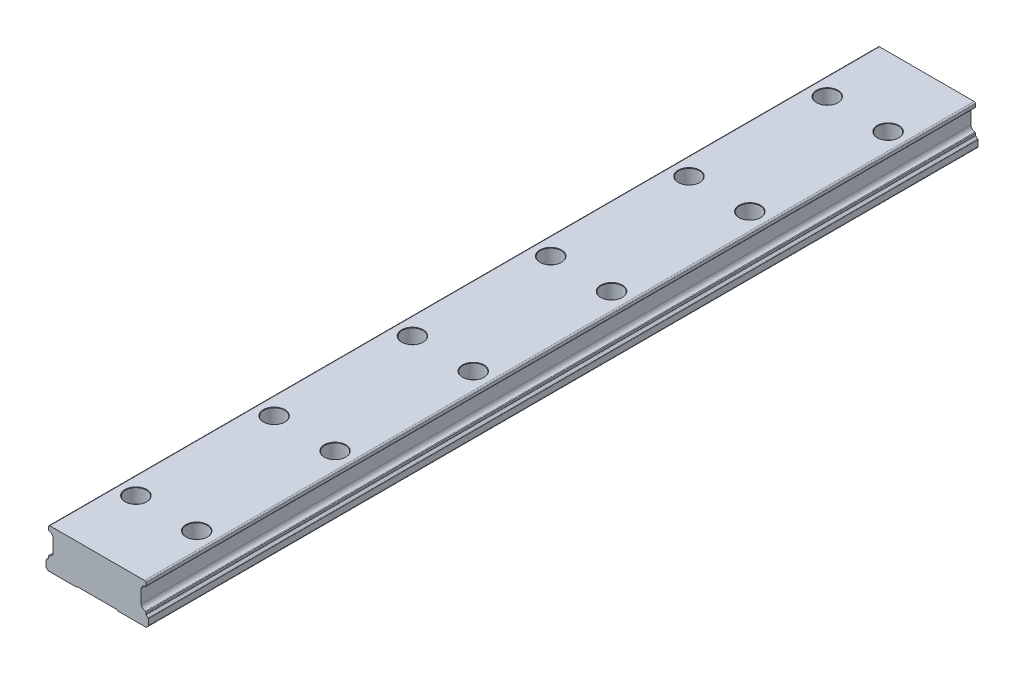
from build123d import *

# Parameters (mm, degrees)
EXTRUDE_2_DEPTH  = 300
HOLE1_AT_2_COUNT = 2
HOLE1_AT_2_PITCH = 22
COPY1_COUNT      = 6
COPY1_PITCH      = 50
FILLET2_R        = 0.25
FILLET3_R        = 0.5


with BuildPart() as part:
    # Sketch 1 → Extrude 2 (new body)
    with BuildSketch(Plane.XY):
        with BuildLine():
            Line((-17.75, 0), (-7.5, 0))
            Line((-7.5, 0), (-7.2, 0.3))
            Line((-7.2, 0.3), (7.2, 0.3))
            Line((7.2, 0.3), (7.5, 0))
            Line((7.5, 0), (17.75, 0))
            Line((17.75, 0), (18.353553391, 0.603553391))
            ThreePointArc((18.353553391, 0.603553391), (18.461939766, 0.765765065), (18.5, 0.957106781))
            Line((18.5, 0.957106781), (18.5, 3.078233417))
            ThreePointArc((18.5, 3.078233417), (18.476576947, 3.183887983), (18.410696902, 3.269744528))
            Line((18.410696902, 3.269744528), (17.689303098, 3.875065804))
            ThreePointArc((17.689303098, 3.875065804), (17.623423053, 3.960922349), (17.6, 4.066576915))
            Line((17.6, 4.066576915), (17.6, 4.704144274))
            ThreePointArc((17.6, 4.704144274), (17.535590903, 4.871643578), (17.375551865, 4.952835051))
            ThreePointArc((17.375551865, 4.952835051), (16.400987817, 5.404413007), (15.91087357, 6.360177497))
            Line((15.91087357, 6.360177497), (15.91087357, 11.239822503))
            ThreePointArc((15.91087357, 11.239822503), (16.400987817, 12.195586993), (17.375551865, 12.647164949))
            ThreePointArc((17.375551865, 12.647164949), (17.535590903, 12.728356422), (17.6, 12.895855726))
            Line((17.6, 12.895855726), (17.6, 13.9))
            ThreePointArc((17.6, 13.9), (17.453553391, 14.253553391), (17.1, 14.4))
            Line((17.1, 14.4), (-17.1, 14.4))
            ThreePointArc((-17.1, 14.4), (-17.453553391, 14.253553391), (-17.6, 13.9))
            Line((-17.6, 13.9), (-17.6, 12.895855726))
            ThreePointArc((-17.6, 12.895855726), (-17.535590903, 12.728356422), (-17.375551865, 12.647164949))
            ThreePointArc((-17.375551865, 12.647164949), (-16.400987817, 12.195586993), (-15.91087357, 11.239822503))
            Line((-15.91087357, 11.239822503), (-15.91087357, 6.360177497))
            ThreePointArc((-15.91087357, 6.360177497), (-16.400987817, 5.404413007), (-17.375551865, 4.952835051))
            ThreePointArc((-17.375551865, 4.952835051), (-17.535590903, 4.871643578), (-17.6, 4.704144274))
            Line((-17.6, 4.704144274), (-17.6, 4.066576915))
            ThreePointArc((-17.6, 4.066576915), (-17.623423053, 3.960922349), (-17.689303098, 3.875065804))
            Line((-17.689303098, 3.875065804), (-18.410696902, 3.269744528))
            ThreePointArc((-18.410696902, 3.269744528), (-18.476576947, 3.183887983), (-18.5, 3.078233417))
            Line((-18.5, 3.078233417), (-18.5, 0.957106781))
            ThreePointArc((-18.5, 0.957106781), (-18.461939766, 0.765765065), (-18.353553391, 0.603553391))
            Line((-18.353553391, 0.603553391), (-17.75, 0))
        make_face()
    extrude(amount=EXTRUDE_2_DEPTH)

    # Sketch 7 → Hole1 (revolve, cut)
    with BuildSketch(Plane(origin=(11, 14.4, 25), x_dir=(0, 0, 1), z_dir=(1, 0, 0))):
        Polygon((0, 0), (0, 14.4), (2.5, 14.4), (2.25, 14.15), (2.25, 5.3), (3.75, 5.3), (3.75, 0.15), (3.9, 0), align=None)
    hole1 = revolve(axis=Axis((11, 20.75, 25), (0, -1, 0)), mode=Mode.SUBTRACT)

    # Hole1 at 2: Hole1 ×2
    with Locations(*[(-i * HOLE1_AT_2_PITCH, 0, 0) for i in range(1, HOLE1_AT_2_COUNT)]):
        add(hole1, mode=Mode.SUBTRACT)

    # Copy1: Hole1 ×6
    with Locations(*[(0, 0, i * COPY1_PITCH) for i in range(1, COPY1_COUNT)]):
        add(hole1, mode=Mode.SUBTRACT)

    # Copy1 copy 1 sketch → Copy1 copy 1 (revolve, cut)
    with BuildSketch(Plane(origin=(-11, 14.4, 75), x_dir=(0, 0, 1), z_dir=(1, 0, 0))):
        Polygon((0, 0), (0, 14.4), (2.5, 14.4), (2.25, 14.15), (2.25, 5.3), (3.75, 5.3), (3.75, 0.15), (3.9, 0), align=None)
    revolve(axis=Axis((-11, 20.75, 75), (0, -1, 0)), mode=Mode.SUBTRACT)

    # Copy1 copy 2 sketch → Copy1 copy 2 (revolve, cut)
    with BuildSketch(Plane(origin=(-11, 14.4, 125), x_dir=(0, 0, 1), z_dir=(1, 0, 0))):
        Polygon((0, 0), (0, 14.4), (2.5, 14.4), (2.25, 14.15), (2.25, 5.3), (3.75, 5.3), (3.75, 0.15), (3.9, 0), align=None)
    revolve(axis=Axis((-11, 20.75, 125), (0, -1, 0)), mode=Mode.SUBTRACT)

    # Copy1 copy 3 sketch → Copy1 copy 3 (revolve, cut)
    with BuildSketch(Plane(origin=(-11, 14.4, 175), x_dir=(0, 0, 1), z_dir=(1, 0, 0))):
        Polygon((0, 0), (0, 14.4), (2.5, 14.4), (2.25, 14.15), (2.25, 5.3), (3.75, 5.3), (3.75, 0.15), (3.9, 0), align=None)
    revolve(axis=Axis((-11, 20.75, 175), (0, -1, 0)), mode=Mode.SUBTRACT)

    # Copy1 copy 4 sketch → Copy1 copy 4 (revolve, cut)
    with BuildSketch(Plane(origin=(-11, 14.4, 225), x_dir=(0, 0, 1), z_dir=(1, 0, 0))):
        Polygon((0, 0), (0, 14.4), (2.5, 14.4), (2.25, 14.15), (2.25, 5.3), (3.75, 5.3), (3.75, 0.15), (3.9, 0), align=None)
    revolve(axis=Axis((-11, 20.75, 225), (0, -1, 0)), mode=Mode.SUBTRACT)

    # Copy1 copy 5 sketch → Copy1 copy 5 (revolve, cut)
    with BuildSketch(Plane(origin=(-11, 14.4, 275), x_dir=(0, 0, 1), z_dir=(1, 0, 0))):
        Polygon((0, 0), (0, 14.4), (2.5, 14.4), (2.25, 14.15), (2.25, 5.3), (3.75, 5.3), (3.75, 0.15), (3.9, 0), align=None)
    revolve(axis=Axis((-11, 20.75, 275), (0, -1, 0)), mode=Mode.SUBTRACT)

    # Fillet2
    fillet2_edges = [part.edges().sort_by_distance(p)[0] for p in [
        (17.75, 0, 150),
        (7.5, 0, 150),
        (-7.5, 0, 150),
        (-17.75, 0, 150),
    ]]
    fillet(fillet2_edges, radius=FILLET2_R)

    # Fillet3
    fillet3_edges = [part.edges().sort_by_distance(p)[0] for p in [
        (7.2, 0.3, 150),
        (-7.2, 0.3, 150),
    ]]
    fillet(fillet3_edges, radius=FILLET3_R)


solid = part.part
